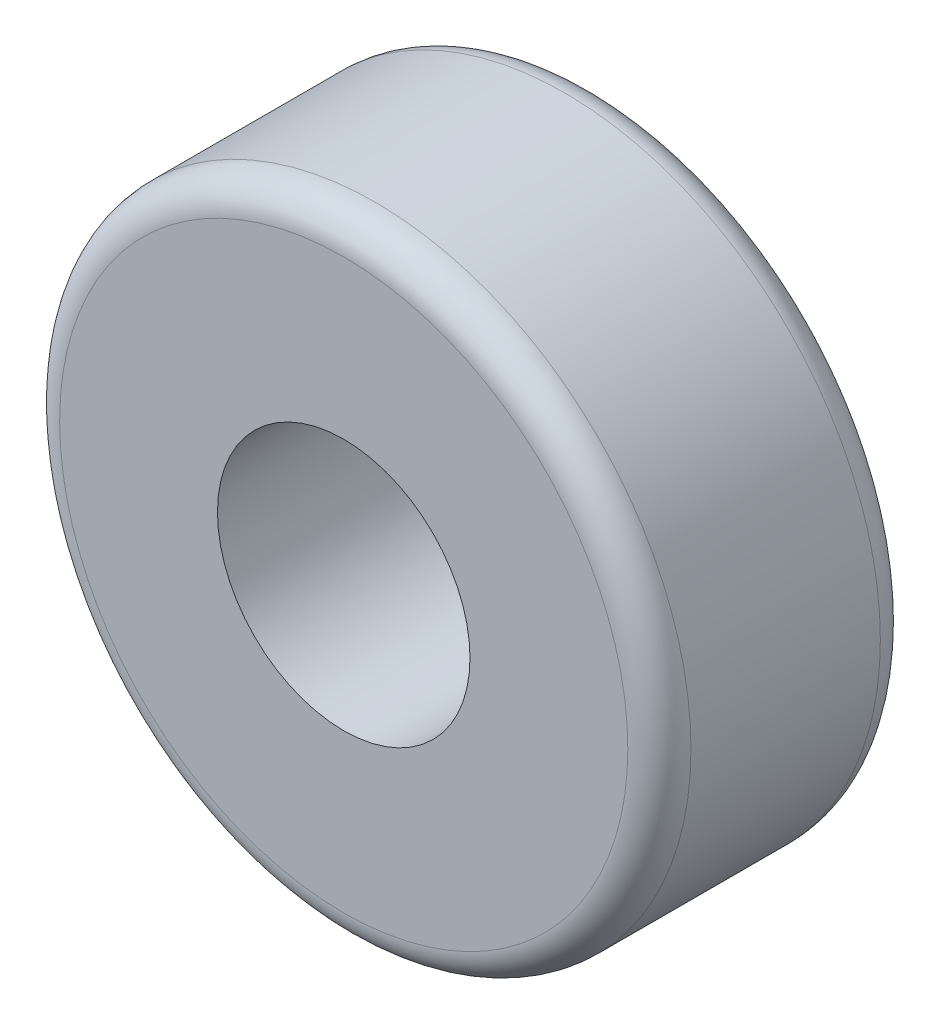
ISO-10303-21;
HEADER;
FILE_DESCRIPTION(('STEP AP214'),'2;1');
FILE_NAME('part.step','',(''),(''),'','','');
FILE_SCHEMA(('AUTOMOTIVE_DESIGN { 1 0 10303 214 1 1 1 1 }'));
ENDSEC;
DATA;
#1=APPLICATION_CONTEXT('core data for automotive mechanical design processes');
#2=APPLICATION_PROTOCOL_DEFINITION('international standard','automotive_design',2000,#1);
#3=PRODUCT_CONTEXT('',#1,'mechanical');
#4=PRODUCT('Part','Part','',(#3));
#5=PRODUCT_RELATED_PRODUCT_CATEGORY('part','',(#4));
#6=PRODUCT_DEFINITION_FORMATION('','',#4);
#7=PRODUCT_DEFINITION_CONTEXT('part definition',#1,'design');
#8=PRODUCT_DEFINITION('design','',#6,#7);
#9=PRODUCT_DEFINITION_SHAPE('','',#8);
#10=(LENGTH_UNIT() NAMED_UNIT(*) SI_UNIT(.MILLI.,.METRE.));
#11=(NAMED_UNIT(*) PLANE_ANGLE_UNIT() SI_UNIT($,.RADIAN.));
#12=(NAMED_UNIT(*) SI_UNIT($,.STERADIAN.) SOLID_ANGLE_UNIT());
#13=UNCERTAINTY_MEASURE_WITH_UNIT(LENGTH_MEASURE(1.E-05),#10,'distance_accuracy_value','');
#14=(GEOMETRIC_REPRESENTATION_CONTEXT(3) GLOBAL_UNCERTAINTY_ASSIGNED_CONTEXT((#13)) GLOBAL_UNIT_ASSIGNED_CONTEXT((#10,
#11,#12)) REPRESENTATION_CONTEXT('',''));
#15=CARTESIAN_POINT('',(0.,0.,0.));
#16=DIRECTION('',(0.,0.,1.));
#17=DIRECTION('',(1.,0.,0.));
#18=AXIS2_PLACEMENT_3D('',#15,#16,#17);
#19=CARTESIAN_POINT('',(0.,-8.,16.));
#20=DIRECTION('',(0.,0.,1.));
#21=DIRECTION('',(1.,0.,0.));
#22=AXIS2_PLACEMENT_3D('',#19,#20,#21);
#23=PLANE('',#22);
#24=CARTESIAN_POINT('',(0.,0.,16.));
#25=DIRECTION('',(0.,0.,1.));
#26=DIRECTION('',(1.,0.,0.));
#27=AXIS2_PLACEMENT_3D('',#24,#25,#26);
#28=CIRCLE('',#27,18.);
#29=CARTESIAN_POINT('',(18.,0.,16.));
#30=VERTEX_POINT('',#29);
#31=EDGE_CURVE('E8',#30,#30,#28,.T.);
#32=ORIENTED_EDGE('',*,*,#31,.T.);
#33=EDGE_LOOP('',(#32));
#34=FACE_BOUND('',#33,.T.);
#35=CARTESIAN_POINT('',(0.,0.,16.));
#36=DIRECTION('',(0.,0.,1.));
#37=DIRECTION('',(1.,0.,0.));
#38=AXIS2_PLACEMENT_3D('',#35,#36,#37);
#39=CIRCLE('',#38,8.);
#40=CARTESIAN_POINT('',(8.,0.,16.));
#41=VERTEX_POINT('',#40);
#42=EDGE_CURVE('E34',#41,#41,#39,.T.);
#43=ORIENTED_EDGE('',*,*,#42,.F.);
#44=EDGE_LOOP('',(#43));
#45=FACE_BOUND('',#44,.T.);
#46=ADVANCED_FACE('F12',(#34,#45),#23,.T.);
#47=CARTESIAN_POINT('',(0.,0.,14.));
#48=DIRECTION('',(0.,0.,1.));
#49=DIRECTION('',(1.,0.,0.));
#50=AXIS2_PLACEMENT_3D('',#47,#48,#49);
#51=TOROIDAL_SURFACE('',#50,18.,2.);
#52=CARTESIAN_POINT('',(0.,0.,14.));
#53=DIRECTION('',(0.,0.,1.));
#54=DIRECTION('',(1.,0.,0.));
#55=AXIS2_PLACEMENT_3D('',#52,#53,#54);
#56=CIRCLE('',#55,20.);
#57=CARTESIAN_POINT('',(20.,0.,14.));
#58=VERTEX_POINT('',#57);
#59=EDGE_CURVE('E18',#58,#58,#56,.T.);
#60=ORIENTED_EDGE('',*,*,#59,.T.);
#61=EDGE_LOOP('',(#60));
#62=FACE_BOUND('',#61,.T.);
#63=ORIENTED_EDGE('',*,*,#31,.F.);
#64=EDGE_LOOP('',(#63));
#65=FACE_BOUND('',#64,.T.);
#66=ADVANCED_FACE('F41',(#62,#65),#51,.T.);
#67=CARTESIAN_POINT('',(0.,0.,32.9727316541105));
#68=DIRECTION('',(0.,0.,1.));
#69=DIRECTION('',(1.,0.,0.));
#70=AXIS2_PLACEMENT_3D('',#67,#68,#69);
#71=CYLINDRICAL_SURFACE('',#70,20.);
#72=CARTESIAN_POINT('',(0.,0.,2.));
#73=DIRECTION('',(0.,0.,1.));
#74=DIRECTION('',(1.,0.,0.));
#75=AXIS2_PLACEMENT_3D('',#72,#73,#74);
#76=CIRCLE('',#75,20.);
#77=CARTESIAN_POINT('',(20.,0.,2.));
#78=VERTEX_POINT('',#77);
#79=EDGE_CURVE('E22',#78,#78,#76,.T.);
#80=ORIENTED_EDGE('',*,*,#79,.T.);
#81=EDGE_LOOP('',(#80));
#82=FACE_BOUND('',#81,.T.);
#83=ORIENTED_EDGE('',*,*,#59,.F.);
#84=EDGE_LOOP('',(#83));
#85=FACE_BOUND('',#84,.T.);
#86=ADVANCED_FACE('F47',(#82,#85),#71,.T.);
#87=CARTESIAN_POINT('',(0.,0.,2.));
#88=DIRECTION('',(0.,0.,1.));
#89=DIRECTION('',(1.,0.,0.));
#90=AXIS2_PLACEMENT_3D('',#87,#88,#89);
#91=TOROIDAL_SURFACE('',#90,18.,2.);
#92=CARTESIAN_POINT('',(0.,0.,0.));
#93=DIRECTION('',(0.,0.,1.));
#94=DIRECTION('',(1.,0.,0.));
#95=AXIS2_PLACEMENT_3D('',#92,#93,#94);
#96=CIRCLE('',#95,18.);
#97=CARTESIAN_POINT('',(18.,0.,0.));
#98=VERTEX_POINT('',#97);
#99=EDGE_CURVE('E26',#98,#98,#96,.T.);
#100=ORIENTED_EDGE('',*,*,#99,.T.);
#101=EDGE_LOOP('',(#100));
#102=FACE_BOUND('',#101,.T.);
#103=ORIENTED_EDGE('',*,*,#79,.F.);
#104=EDGE_LOOP('',(#103));
#105=FACE_BOUND('',#104,.T.);
#106=ADVANCED_FACE('F52',(#102,#105),#91,.T.);
#107=CARTESIAN_POINT('',(0.,-18.,0.));
#108=DIRECTION('',(0.,0.,-1.));
#109=DIRECTION('',(-1.,0.,0.));
#110=AXIS2_PLACEMENT_3D('',#107,#108,#109);
#111=PLANE('',#110);
#112=CARTESIAN_POINT('',(0.,0.,0.));
#113=DIRECTION('',(0.,0.,1.));
#114=DIRECTION('',(1.,0.,0.));
#115=AXIS2_PLACEMENT_3D('',#112,#113,#114);
#116=CIRCLE('',#115,8.);
#117=CARTESIAN_POINT('',(8.,0.,0.));
#118=VERTEX_POINT('',#117);
#119=EDGE_CURVE('E31',#118,#118,#116,.T.);
#120=ORIENTED_EDGE('',*,*,#119,.T.);
#121=EDGE_LOOP('',(#120));
#122=FACE_BOUND('',#121,.T.);
#123=ORIENTED_EDGE('',*,*,#99,.F.);
#124=EDGE_LOOP('',(#123));
#125=FACE_BOUND('',#124,.T.);
#126=ADVANCED_FACE('F59',(#122,#125),#111,.T.);
#127=CARTESIAN_POINT('',(0.,0.,32.9727316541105));
#128=DIRECTION('',(0.,0.,1.));
#129=DIRECTION('',(1.,0.,0.));
#130=AXIS2_PLACEMENT_3D('',#127,#128,#129);
#131=CYLINDRICAL_SURFACE('',#130,8.);
#132=ORIENTED_EDGE('',*,*,#119,.F.);
#133=EDGE_LOOP('',(#132));
#134=FACE_BOUND('',#133,.T.);
#135=ORIENTED_EDGE('',*,*,#42,.T.);
#136=EDGE_LOOP('',(#135));
#137=FACE_BOUND('',#136,.T.);
#138=ADVANCED_FACE('F38',(#134,#137),#131,.F.);
#139=CLOSED_SHELL('',(#46,#66,#86,#106,#126,#138));
#140=MANIFOLD_SOLID_BREP('B1',#139);
#141=ADVANCED_BREP_SHAPE_REPRESENTATION('',(#18,#140),#14);
#142=SHAPE_DEFINITION_REPRESENTATION(#9,#141);
ENDSEC;
END-ISO-10303-21;
